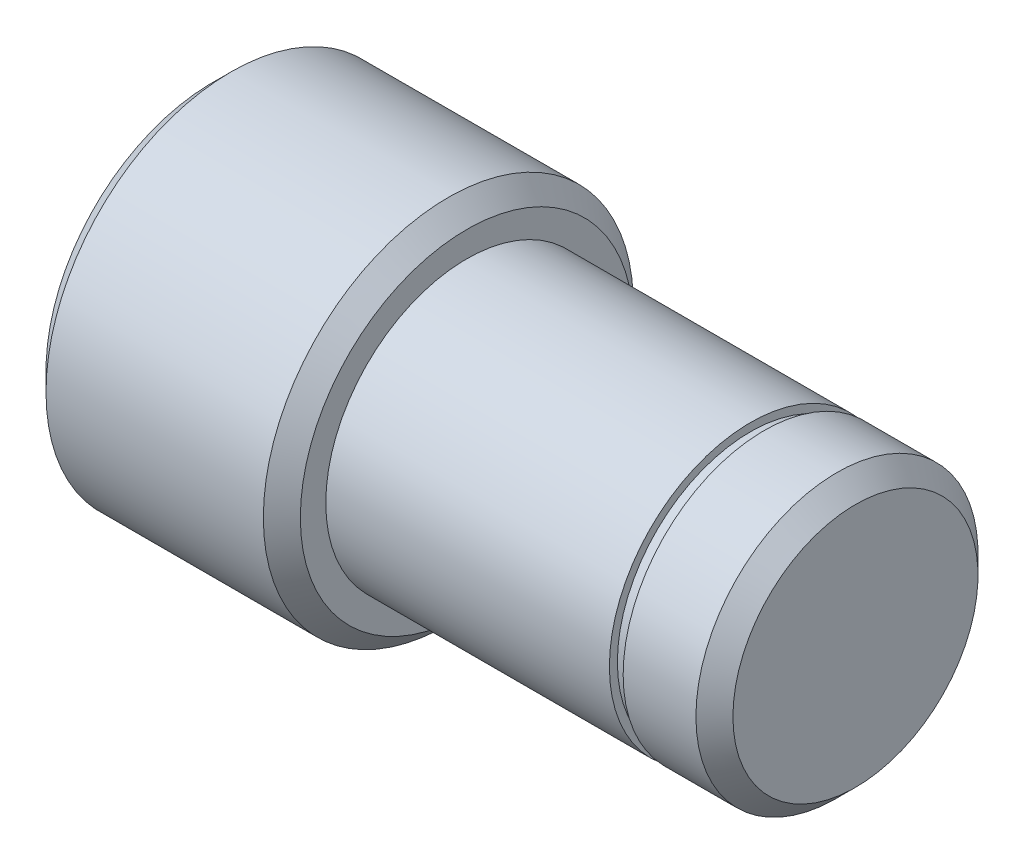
ISO-10303-21;
HEADER;
FILE_DESCRIPTION(('STEP AP214'),'2;1');
FILE_NAME('part.step','',(''),(''),'','','');
FILE_SCHEMA(('AUTOMOTIVE_DESIGN { 1 0 10303 214 1 1 1 1 }'));
ENDSEC;
DATA;
#1=APPLICATION_CONTEXT('core data for automotive mechanical design processes');
#2=APPLICATION_PROTOCOL_DEFINITION('international standard','automotive_design',2000,#1);
#3=PRODUCT_CONTEXT('',#1,'mechanical');
#4=PRODUCT('Part','Part','',(#3));
#5=PRODUCT_RELATED_PRODUCT_CATEGORY('part','',(#4));
#6=PRODUCT_DEFINITION_FORMATION('','',#4);
#7=PRODUCT_DEFINITION_CONTEXT('part definition',#1,'design');
#8=PRODUCT_DEFINITION('design','',#6,#7);
#9=PRODUCT_DEFINITION_SHAPE('','',#8);
#10=(LENGTH_UNIT() NAMED_UNIT(*) SI_UNIT(.MILLI.,.METRE.));
#11=(NAMED_UNIT(*) PLANE_ANGLE_UNIT() SI_UNIT($,.RADIAN.));
#12=(NAMED_UNIT(*) SI_UNIT($,.STERADIAN.) SOLID_ANGLE_UNIT());
#13=UNCERTAINTY_MEASURE_WITH_UNIT(LENGTH_MEASURE(1.E-05),#10,'distance_accuracy_value','');
#14=(GEOMETRIC_REPRESENTATION_CONTEXT(3) GLOBAL_UNCERTAINTY_ASSIGNED_CONTEXT((#13)) GLOBAL_UNIT_ASSIGNED_CONTEXT((#10,
#11,#12)) REPRESENTATION_CONTEXT('',''));
#15=CARTESIAN_POINT('',(0.,0.,0.));
#16=DIRECTION('',(0.,0.,1.));
#17=DIRECTION('',(1.,0.,0.));
#18=AXIS2_PLACEMENT_3D('',#15,#16,#17);
#19=CARTESIAN_POINT('',(0.,0.,0.));
#20=DIRECTION('',(-1.,0.,0.));
#21=DIRECTION('',(0.,0.,1.));
#22=AXIS2_PLACEMENT_3D('',#19,#20,#21);
#23=CYLINDRICAL_SURFACE('',#22,19.3675);
#24=CARTESIAN_POINT('',(34.925,0.,0.));
#25=DIRECTION('',(-1.,0.,0.));
#26=DIRECTION('',(0.,0.,1.));
#27=AXIS2_PLACEMENT_3D('',#24,#25,#26);
#28=CIRCLE('',#27,19.3675);
#29=CARTESIAN_POINT('',(34.925,0.,19.3675));
#30=VERTEX_POINT('',#29);
#31=EDGE_CURVE('E55',#30,#30,#28,.T.);
#32=ORIENTED_EDGE('',*,*,#31,.F.);
#33=EDGE_LOOP('',(#32));
#34=FACE_BOUND('',#33,.T.);
#35=CARTESIAN_POINT('',(73.8694246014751,0.,0.));
#36=DIRECTION('',(-1.,0.,0.));
#37=DIRECTION('',(0.,0.,1.));
#38=AXIS2_PLACEMENT_3D('',#35,#36,#37);
#39=CIRCLE('',#38,19.3675);
#40=CARTESIAN_POINT('',(73.8694246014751,0.,19.3675));
#41=VERTEX_POINT('',#40);
#42=EDGE_CURVE('E85',#41,#41,#39,.T.);
#43=ORIENTED_EDGE('',*,*,#42,.T.);
#44=EDGE_LOOP('',(#43));
#45=FACE_BOUND('',#44,.T.);
#46=ADVANCED_FACE('F29',(#34,#45),#23,.T.);
#47=CARTESIAN_POINT('',(0.,0.,0.));
#48=DIRECTION('',(1.,0.,0.));
#49=DIRECTION('',(0.,0.,-1.));
#50=AXIS2_PLACEMENT_3D('',#47,#48,#49);
#51=PLANE('',#50);
#52=CARTESIAN_POINT('',(0.,-8.3566,0.));
#53=DIRECTION('',(-1.,0.,0.));
#54=DIRECTION('',(0.,0.,1.));
#55=AXIS2_PLACEMENT_3D('',#52,#53,#54);
#56=CIRCLE('',#55,3.175);
#57=CARTESIAN_POINT('',(0.,-8.3566,3.175));
#58=VERTEX_POINT('',#57);
#59=EDGE_CURVE('E73',#58,#58,#56,.T.);
#60=ORIENTED_EDGE('',*,*,#59,.F.);
#61=EDGE_LOOP('',(#60));
#62=FACE_BOUND('',#61,.T.);
#63=CARTESIAN_POINT('',(0.,0.,-19.05));
#64=DIRECTION('',(-1.,0.,0.));
#65=DIRECTION('',(0.,0.,1.));
#66=AXIS2_PLACEMENT_3D('',#63,#64,#65);
#67=CIRCLE('',#66,2.413);
#68=CARTESIAN_POINT('',(0.,0.,-16.637));
#69=VERTEX_POINT('',#68);
#70=EDGE_CURVE('E67',#69,#69,#67,.T.);
#71=ORIENTED_EDGE('',*,*,#70,.F.);
#72=EDGE_LOOP('',(#71));
#73=FACE_BOUND('',#72,.T.);
#74=CARTESIAN_POINT('',(0.,0.,19.05));
#75=DIRECTION('',(-1.,0.,0.));
#76=DIRECTION('',(0.,0.,1.));
#77=AXIS2_PLACEMENT_3D('',#74,#75,#76);
#78=CIRCLE('',#77,2.413);
#79=CARTESIAN_POINT('',(0.,0.,21.463));
#80=VERTEX_POINT('',#79);
#81=EDGE_CURVE('E61',#80,#80,#78,.T.);
#82=ORIENTED_EDGE('',*,*,#81,.F.);
#83=EDGE_LOOP('',(#82));
#84=FACE_BOUND('',#83,.T.);
#85=CARTESIAN_POINT('',(0.,0.,0.));
#86=DIRECTION('',(1.,0.,0.));
#87=DIRECTION('',(0.,0.,-1.));
#88=AXIS2_PLACEMENT_3D('',#85,#86,#87);
#89=CIRCLE('',#88,22.86);
#90=CARTESIAN_POINT('',(0.,0.,-22.86));
#91=VERTEX_POINT('',#90);
#92=EDGE_CURVE('E10',#91,#91,#89,.F.);
#93=ORIENTED_EDGE('',*,*,#92,.T.);
#94=EDGE_LOOP('',(#93));
#95=FACE_BOUND('',#94,.T.);
#96=ADVANCED_FACE('F31',(#62,#73,#84,#95),#51,.F.);
#97=CARTESIAN_POINT('',(0.,0.,0.));
#98=DIRECTION('',(-1.,0.,0.));
#99=DIRECTION('',(0.,0.,1.));
#100=AXIS2_PLACEMENT_3D('',#97,#98,#99);
#101=CYLINDRICAL_SURFACE('',#100,25.4);
#102=CARTESIAN_POINT('',(32.385,0.,0.));
#103=DIRECTION('',(-1.,0.,0.));
#104=DIRECTION('',(0.,0.,1.));
#105=AXIS2_PLACEMENT_3D('',#102,#103,#104);
#106=CIRCLE('',#105,25.4);
#107=CARTESIAN_POINT('',(32.385,0.,25.4));
#108=VERTEX_POINT('',#107);
#109=EDGE_CURVE('E40',#108,#108,#106,.T.);
#110=ORIENTED_EDGE('',*,*,#109,.T.);
#111=EDGE_LOOP('',(#110));
#112=FACE_BOUND('',#111,.T.);
#113=CARTESIAN_POINT('',(2.54000000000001,0.,0.));
#114=DIRECTION('',(1.,0.,0.));
#115=DIRECTION('',(0.,0.,-1.));
#116=AXIS2_PLACEMENT_3D('',#113,#114,#115);
#117=CIRCLE('',#116,25.4);
#118=CARTESIAN_POINT('',(2.54000000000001,0.,-25.4));
#119=VERTEX_POINT('',#118);
#120=EDGE_CURVE('E44',#119,#119,#117,.T.);
#121=ORIENTED_EDGE('',*,*,#120,.T.);
#122=EDGE_LOOP('',(#121));
#123=FACE_BOUND('',#122,.T.);
#124=ADVANCED_FACE('F113',(#112,#123),#101,.T.);
#125=CARTESIAN_POINT('',(34.925,25.4,0.));
#126=DIRECTION('',(-1.,0.,0.));
#127=DIRECTION('',(0.,0.,1.));
#128=AXIS2_PLACEMENT_3D('',#125,#126,#127);
#129=PLANE('',#128);
#130=CARTESIAN_POINT('',(34.925,0.,0.));
#131=DIRECTION('',(-1.,0.,0.));
#132=DIRECTION('',(0.,0.,1.));
#133=AXIS2_PLACEMENT_3D('',#130,#131,#132);
#134=CIRCLE('',#133,22.86);
#135=CARTESIAN_POINT('',(34.925,0.,22.86));
#136=VERTEX_POINT('',#135);
#137=EDGE_CURVE('E36',#136,#136,#134,.F.);
#138=ORIENTED_EDGE('',*,*,#137,.T.);
#139=EDGE_LOOP('',(#138));
#140=FACE_BOUND('',#139,.T.);
#141=ORIENTED_EDGE('',*,*,#31,.T.);
#142=EDGE_LOOP('',(#141));
#143=FACE_BOUND('',#142,.T.);
#144=ADVANCED_FACE('F149',(#140,#143),#129,.F.);
#145=CARTESIAN_POINT('',(32.385,0.,0.));
#146=DIRECTION('',(-1.,0.,0.));
#147=DIRECTION('',(0.,0.,1.));
#148=AXIS2_PLACEMENT_3D('',#145,#146,#147);
#149=CONICAL_SURFACE('',#148,25.4,0.785398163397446);
#150=ORIENTED_EDGE('',*,*,#137,.F.);
#151=EDGE_LOOP('',(#150));
#152=FACE_BOUND('',#151,.T.);
#153=ORIENTED_EDGE('',*,*,#109,.F.);
#154=EDGE_LOOP('',(#153));
#155=FACE_BOUND('',#154,.T.);
#156=ADVANCED_FACE('F145',(#152,#155),#149,.T.);
#157=CARTESIAN_POINT('',(0.,0.,0.));
#158=DIRECTION('',(1.,0.,0.));
#159=DIRECTION('',(0.,0.,-1.));
#160=AXIS2_PLACEMENT_3D('',#157,#158,#159);
#161=CONICAL_SURFACE('',#160,22.86,0.785398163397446);
#162=ORIENTED_EDGE('',*,*,#120,.F.);
#163=EDGE_LOOP('',(#162));
#164=FACE_BOUND('',#163,.T.);
#165=ORIENTED_EDGE('',*,*,#92,.F.);
#166=EDGE_LOOP('',(#165));
#167=FACE_BOUND('',#166,.T.);
#168=ADVANCED_FACE('F148',(#164,#167),#161,.T.);
#169=CARTESIAN_POINT('',(6.35,0.,19.05));
#170=DIRECTION('',(-1.,0.,0.));
#171=DIRECTION('',(0.,0.,1.));
#172=AXIS2_PLACEMENT_3D('',#169,#170,#171);
#173=CYLINDRICAL_SURFACE('',#172,2.413);
#174=CARTESIAN_POINT('',(6.35,0.,19.05));
#175=DIRECTION('',(-1.,0.,0.));
#176=DIRECTION('',(0.,0.,1.));
#177=AXIS2_PLACEMENT_3D('',#174,#175,#176);
#178=CIRCLE('',#177,2.413);
#179=CARTESIAN_POINT('',(6.35,0.,21.463));
#180=VERTEX_POINT('',#179);
#181=EDGE_CURVE('E58',#180,#180,#178,.T.);
#182=ORIENTED_EDGE('',*,*,#181,.F.);
#183=EDGE_LOOP('',(#182));
#184=FACE_BOUND('',#183,.T.);
#185=ORIENTED_EDGE('',*,*,#81,.T.);
#186=EDGE_LOOP('',(#185));
#187=FACE_BOUND('',#186,.T.);
#188=ADVANCED_FACE('F153',(#184,#187),#173,.F.);
#189=CARTESIAN_POINT('',(6.35,0.,19.05));
#190=DIRECTION('',(-1.,0.,0.));
#191=DIRECTION('',(0.,0.,1.));
#192=AXIS2_PLACEMENT_3D('',#189,#190,#191);
#193=PLANE('',#192);
#194=ORIENTED_EDGE('',*,*,#181,.T.);
#195=EDGE_LOOP('',(#194));
#196=FACE_BOUND('',#195,.T.);
#197=ADVANCED_FACE('F157',(#196),#193,.T.);
#198=CARTESIAN_POINT('',(6.35,0.,-19.05));
#199=DIRECTION('',(-1.,0.,0.));
#200=DIRECTION('',(0.,0.,1.));
#201=AXIS2_PLACEMENT_3D('',#198,#199,#200);
#202=CYLINDRICAL_SURFACE('',#201,2.413);
#203=CARTESIAN_POINT('',(6.35,0.,-19.05));
#204=DIRECTION('',(-1.,0.,0.));
#205=DIRECTION('',(0.,0.,1.));
#206=AXIS2_PLACEMENT_3D('',#203,#204,#205);
#207=CIRCLE('',#206,2.413);
#208=CARTESIAN_POINT('',(6.35,0.,-16.637));
#209=VERTEX_POINT('',#208);
#210=EDGE_CURVE('E64',#209,#209,#207,.T.);
#211=ORIENTED_EDGE('',*,*,#210,.F.);
#212=EDGE_LOOP('',(#211));
#213=FACE_BOUND('',#212,.T.);
#214=ORIENTED_EDGE('',*,*,#70,.T.);
#215=EDGE_LOOP('',(#214));
#216=FACE_BOUND('',#215,.T.);
#217=ADVANCED_FACE('F161',(#213,#216),#202,.F.);
#218=CARTESIAN_POINT('',(6.35,0.,-19.05));
#219=DIRECTION('',(-1.,0.,0.));
#220=DIRECTION('',(0.,0.,1.));
#221=AXIS2_PLACEMENT_3D('',#218,#219,#220);
#222=PLANE('',#221);
#223=ORIENTED_EDGE('',*,*,#210,.T.);
#224=EDGE_LOOP('',(#223));
#225=FACE_BOUND('',#224,.T.);
#226=ADVANCED_FACE('F165',(#225),#222,.T.);
#227=CARTESIAN_POINT('',(6.35,-8.3566,0.));
#228=DIRECTION('',(-1.,0.,0.));
#229=DIRECTION('',(0.,0.,1.));
#230=AXIS2_PLACEMENT_3D('',#227,#228,#229);
#231=CYLINDRICAL_SURFACE('',#230,3.175);
#232=CARTESIAN_POINT('',(6.35,-8.3566,0.));
#233=DIRECTION('',(-1.,0.,0.));
#234=DIRECTION('',(0.,0.,1.));
#235=AXIS2_PLACEMENT_3D('',#232,#233,#234);
#236=CIRCLE('',#235,3.175);
#237=CARTESIAN_POINT('',(6.35,-8.3566,3.175));
#238=VERTEX_POINT('',#237);
#239=EDGE_CURVE('E70',#238,#238,#236,.T.);
#240=ORIENTED_EDGE('',*,*,#239,.F.);
#241=EDGE_LOOP('',(#240));
#242=FACE_BOUND('',#241,.T.);
#243=ORIENTED_EDGE('',*,*,#59,.T.);
#244=EDGE_LOOP('',(#243));
#245=FACE_BOUND('',#244,.T.);
#246=ADVANCED_FACE('F104',(#242,#245),#231,.F.);
#247=CARTESIAN_POINT('',(6.35,-8.3566,0.));
#248=DIRECTION('',(-1.,0.,0.));
#249=DIRECTION('',(0.,0.,1.));
#250=AXIS2_PLACEMENT_3D('',#247,#248,#249);
#251=PLANE('',#250);
#252=ORIENTED_EDGE('',*,*,#239,.T.);
#253=EDGE_LOOP('',(#252));
#254=FACE_BOUND('',#253,.T.);
#255=ADVANCED_FACE('F93',(#254),#251,.T.);
#256=CARTESIAN_POINT('',(73.8694246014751,0.,-19.3675));
#257=DIRECTION('',(1.,0.,0.));
#258=DIRECTION('',(0.,0.,-1.));
#259=AXIS2_PLACEMENT_3D('',#256,#257,#258);
#260=PLANE('',#259);
#261=CARTESIAN_POINT('',(73.8694246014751,0.,0.));
#262=DIRECTION('',(-1.,0.,0.));
#263=DIRECTION('',(0.,0.,1.));
#264=AXIS2_PLACEMENT_3D('',#261,#262,#263);
#265=CIRCLE('',#264,18.2688966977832);
#266=CARTESIAN_POINT('',(73.8694246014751,0.,18.2688966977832));
#267=VERTEX_POINT('',#266);
#268=EDGE_CURVE('E76',#267,#267,#265,.T.);
#269=ORIENTED_EDGE('',*,*,#268,.T.);
#270=EDGE_LOOP('',(#269));
#271=FACE_BOUND('',#270,.T.);
#272=ORIENTED_EDGE('',*,*,#42,.F.);
#273=EDGE_LOOP('',(#272));
#274=FACE_BOUND('',#273,.T.);
#275=ADVANCED_FACE('F90',(#271,#274),#260,.T.);
#276=CARTESIAN_POINT('',(0.,0.,0.));
#277=DIRECTION('',(-1.,0.,0.));
#278=DIRECTION('',(0.,0.,1.));
#279=AXIS2_PLACEMENT_3D('',#276,#277,#278);
#280=CYLINDRICAL_SURFACE('',#279,18.2688966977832);
#281=CARTESIAN_POINT('',(75.7600113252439,0.,0.));
#282=DIRECTION('',(-1.,0.,0.));
#283=DIRECTION('',(0.,0.,1.));
#284=AXIS2_PLACEMENT_3D('',#281,#282,#283);
#285=CIRCLE('',#284,18.2688966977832);
#286=CARTESIAN_POINT('',(75.7600113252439,0.,18.2688966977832));
#287=VERTEX_POINT('',#286);
#288=EDGE_CURVE('E79',#287,#287,#285,.T.);
#289=ORIENTED_EDGE('',*,*,#288,.T.);
#290=EDGE_LOOP('',(#289));
#291=FACE_BOUND('',#290,.T.);
#292=ORIENTED_EDGE('',*,*,#268,.F.);
#293=EDGE_LOOP('',(#292));
#294=FACE_BOUND('',#293,.T.);
#295=ADVANCED_FACE('F92',(#291,#294),#280,.T.);
#296=CARTESIAN_POINT('',(75.7600113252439,0.,-19.3675));
#297=DIRECTION('',(-1.,0.,0.));
#298=DIRECTION('',(0.,0.,1.));
#299=AXIS2_PLACEMENT_3D('',#296,#297,#298);
#300=PLANE('',#299);
#301=CARTESIAN_POINT('',(75.7600113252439,0.,0.));
#302=DIRECTION('',(-1.,0.,0.));
#303=DIRECTION('',(0.,0.,1.));
#304=AXIS2_PLACEMENT_3D('',#301,#302,#303);
#305=CIRCLE('',#304,19.3675);
#306=CARTESIAN_POINT('',(75.7600113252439,0.,19.3675));
#307=VERTEX_POINT('',#306);
#308=EDGE_CURVE('E82',#307,#307,#305,.T.);
#309=ORIENTED_EDGE('',*,*,#308,.T.);
#310=EDGE_LOOP('',(#309));
#311=FACE_BOUND('',#310,.T.);
#312=ORIENTED_EDGE('',*,*,#288,.F.);
#313=EDGE_LOOP('',(#312));
#314=FACE_BOUND('',#313,.T.);
#315=ADVANCED_FACE('F100',(#311,#314),#300,.T.);
#316=CARTESIAN_POINT('',(88.2904,19.3675,0.));
#317=DIRECTION('',(-1.,0.,0.));
#318=DIRECTION('',(0.,0.,1.));
#319=AXIS2_PLACEMENT_3D('',#316,#317,#318);
#320=PLANE('',#319);
#321=CARTESIAN_POINT('',(88.2904,0.,0.));
#322=DIRECTION('',(-1.,0.,0.));
#323=DIRECTION('',(0.,0.,1.));
#324=AXIS2_PLACEMENT_3D('',#321,#322,#323);
#325=CIRCLE('',#324,16.8275);
#326=CARTESIAN_POINT('',(88.2904,0.,16.8275));
#327=VERTEX_POINT('',#326);
#328=EDGE_CURVE('E49',#327,#327,#325,.F.);
#329=ORIENTED_EDGE('',*,*,#328,.T.);
#330=EDGE_LOOP('',(#329));
#331=FACE_BOUND('',#330,.T.);
#332=ADVANCED_FACE('F125',(#331),#320,.F.);
#333=CARTESIAN_POINT('',(85.7504,0.,0.));
#334=DIRECTION('',(-1.,0.,0.));
#335=DIRECTION('',(0.,0.,1.));
#336=AXIS2_PLACEMENT_3D('',#333,#334,#335);
#337=CONICAL_SURFACE('',#336,19.3675,0.785398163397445);
#338=ORIENTED_EDGE('',*,*,#328,.F.);
#339=EDGE_LOOP('',(#338));
#340=FACE_BOUND('',#339,.T.);
#341=CARTESIAN_POINT('',(85.7504,0.,0.));
#342=DIRECTION('',(-1.,0.,0.));
#343=DIRECTION('',(0.,0.,1.));
#344=AXIS2_PLACEMENT_3D('',#341,#342,#343);
#345=CIRCLE('',#344,19.3675);
#346=CARTESIAN_POINT('',(85.7504,0.,19.3675));
#347=VERTEX_POINT('',#346);
#348=EDGE_CURVE('E52',#347,#347,#345,.T.);
#349=ORIENTED_EDGE('',*,*,#348,.F.);
#350=EDGE_LOOP('',(#349));
#351=FACE_BOUND('',#350,.T.);
#352=ADVANCED_FACE('F119',(#340,#351),#337,.T.);
#353=ORIENTED_EDGE('',*,*,#348,.T.);
#354=EDGE_LOOP('',(#353));
#355=FACE_BOUND('',#354,.T.);
#356=ORIENTED_EDGE('',*,*,#308,.F.);
#357=EDGE_LOOP('',(#356));
#358=FACE_BOUND('',#357,.T.);
#359=ADVANCED_FACE('F109',(#355,#358),#23,.T.);
#360=CLOSED_SHELL('',(#46,#96,#124,#144,#156,#168,#188,#197,#217,#226,#246,#255,#275,#295,#315,
#332,#352,#359));
#361=MANIFOLD_SOLID_BREP('B2',#360);
#362=ADVANCED_BREP_SHAPE_REPRESENTATION('',(#18,#361),#14);
#363=SHAPE_DEFINITION_REPRESENTATION(#9,#362);
ENDSEC;
END-ISO-10303-21;
